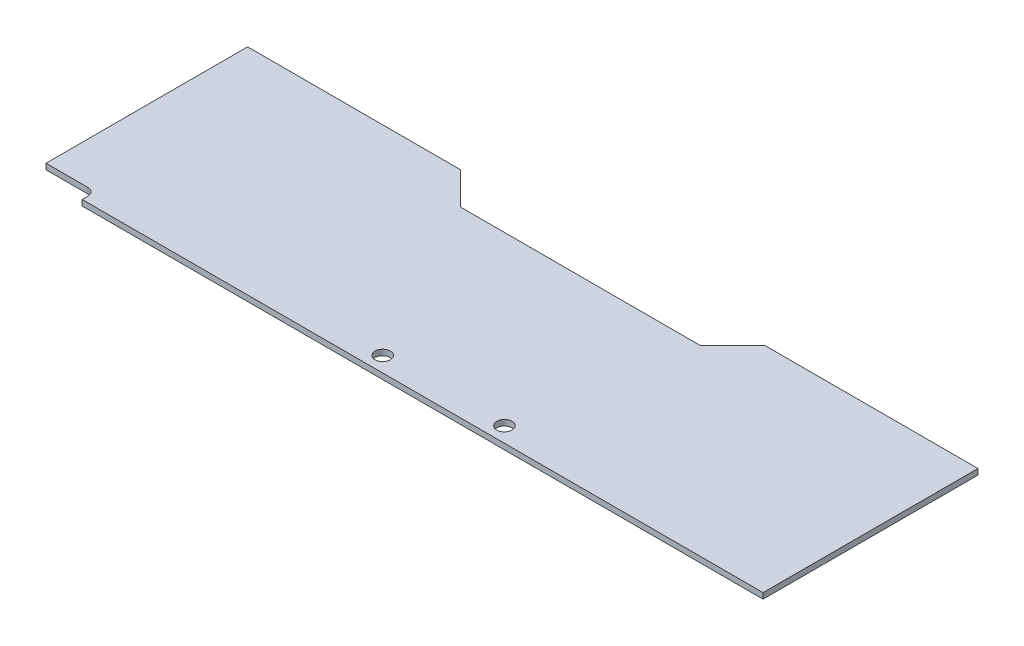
from build123d import *

# Parameters (mm, degrees)
BOSS_EXTRUDE1_DEPTH = 19.05
SKETCH4_R           = 25.4
CUT_EXTRUDE1_DEPTH  = 1272.035421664


with BuildPart() as part:
    # Sketch1 → Boss-Extrude1 (new body)
    with BuildSketch(Plane(origin=(0, 0, 0), x_dir=(1, 0, 0), z_dir=(0, 1, 0))):
        with BuildLine():
            Line((-1219.2, 358.775), (-508, 358.775))
            Line((-508, 358.775), (-400.05, 250.825))
            Line((-400.05, 250.825), (400.05, 250.825))
            Line((400.05, 250.825), (508, 358.775))
            Line((508, 358.775), (1219.2, 358.775))
            Line((1219.2, 358.775), (1219.2, -358.775))
            Line((1219.2, -358.775), (-1054.1, -358.775))
            Line((-1054.1, -358.775), (-1054.1, -339.725))
            ThreePointArc((-1054.1, -339.725), (-1061.539487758, -321.764487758), (-1079.5, -314.325))
            Line((-1079.5, -314.325), (-1219.2, -314.325))
            Line((-1219.2, -314.325), (-1219.2, 358.775))
        make_face()
    extrude(amount=BOSS_EXTRUDE1_DEPTH)

    # Sketch4 → Cut-Extrude1 (cut, through all)
    with BuildSketch(Plane(origin=(0, 19.05, 0), x_dir=(1, 0, 0), z_dir=(0, 1, 0))):
        with Locations(Location((-101.6, -307.975, 0), (0, 0, 270))):
            Circle(SKETCH4_R)
        with Locations(Location((304.8, -307.975, 0), (0, 0, 270))):
            Circle(SKETCH4_R)
    extrude(amount=-CUT_EXTRUDE1_DEPTH, mode=Mode.SUBTRACT)


solid = part.part
